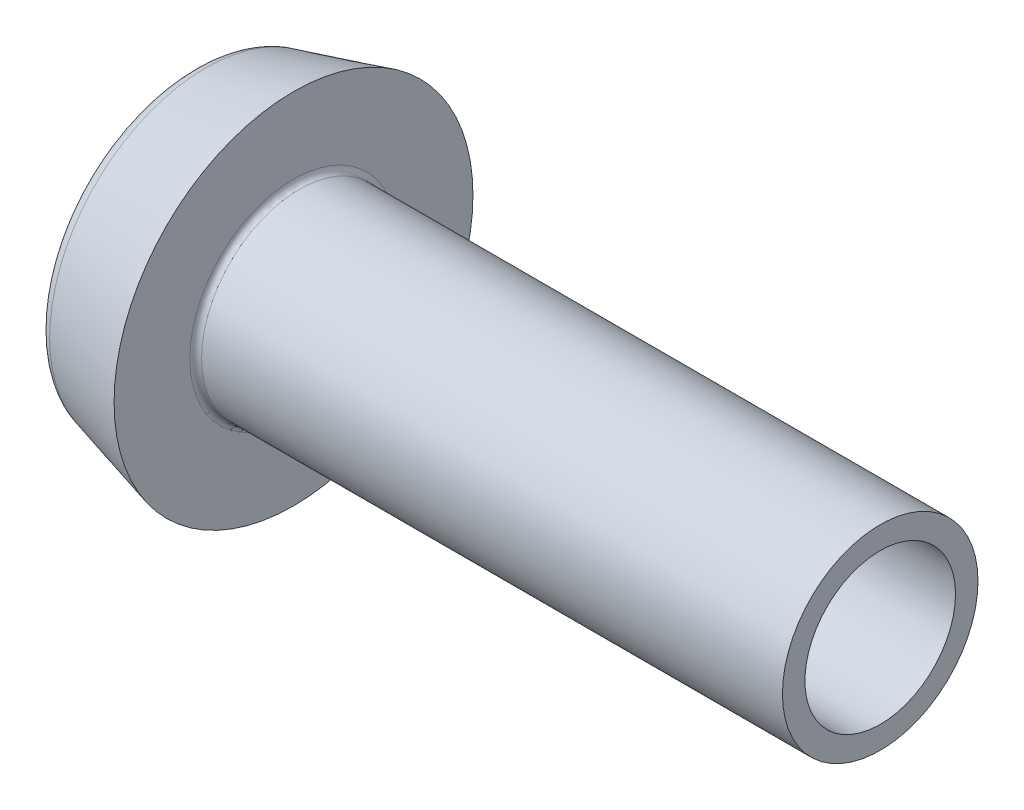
ISO-10303-21;
HEADER;
FILE_DESCRIPTION(('STEP AP214'),'2;1');
FILE_NAME('part.step','',(''),(''),'','','');
FILE_SCHEMA(('AUTOMOTIVE_DESIGN { 1 0 10303 214 1 1 1 1 }'));
ENDSEC;
DATA;
#1=APPLICATION_CONTEXT('core data for automotive mechanical design processes');
#2=APPLICATION_PROTOCOL_DEFINITION('international standard','automotive_design',2000,#1);
#3=PRODUCT_CONTEXT('',#1,'mechanical');
#4=PRODUCT('Part','Part','',(#3));
#5=PRODUCT_RELATED_PRODUCT_CATEGORY('part','',(#4));
#6=PRODUCT_DEFINITION_FORMATION('','',#4);
#7=PRODUCT_DEFINITION_CONTEXT('part definition',#1,'design');
#8=PRODUCT_DEFINITION('design','',#6,#7);
#9=PRODUCT_DEFINITION_SHAPE('','',#8);
#10=(LENGTH_UNIT() NAMED_UNIT(*) SI_UNIT(.MILLI.,.METRE.));
#11=(NAMED_UNIT(*) PLANE_ANGLE_UNIT() SI_UNIT($,.RADIAN.));
#12=(NAMED_UNIT(*) SI_UNIT($,.STERADIAN.) SOLID_ANGLE_UNIT());
#13=UNCERTAINTY_MEASURE_WITH_UNIT(LENGTH_MEASURE(1.E-05),#10,'distance_accuracy_value','');
#14=(GEOMETRIC_REPRESENTATION_CONTEXT(3) GLOBAL_UNCERTAINTY_ASSIGNED_CONTEXT((#13)) GLOBAL_UNIT_ASSIGNED_CONTEXT((#10,
#11,#12)) REPRESENTATION_CONTEXT('',''));
#15=CARTESIAN_POINT('',(0.,0.,0.));
#16=DIRECTION('',(0.,0.,1.));
#17=DIRECTION('',(1.,0.,0.));
#18=AXIS2_PLACEMENT_3D('',#15,#16,#17);
#19=CARTESIAN_POINT('',(35.24,0.,0.));
#20=DIRECTION('',(-1.,0.,0.));
#21=DIRECTION('',(0.,0.,1.));
#22=AXIS2_PLACEMENT_3D('',#19,#20,#21);
#23=PLANE('',#22);
#24=CARTESIAN_POINT('',(35.24,0.,0.));
#25=DIRECTION('',(1.,0.,0.));
#26=DIRECTION('',(0.,0.,-1.));
#27=AXIS2_PLACEMENT_3D('',#24,#25,#26);
#28=CIRCLE('',#27,3.85);
#29=CARTESIAN_POINT('',(35.24,0.,-3.85));
#30=VERTEX_POINT('',#29);
#31=EDGE_CURVE('E53',#30,#30,#28,.T.);
#32=ORIENTED_EDGE('',*,*,#31,.F.);
#33=EDGE_LOOP('',(#32));
#34=FACE_BOUND('',#33,.T.);
#35=CARTESIAN_POINT('',(35.24,0.,0.));
#36=DIRECTION('',(-1.,0.,0.));
#37=DIRECTION('',(0.,0.,1.));
#38=AXIS2_PLACEMENT_3D('',#35,#36,#37);
#39=CIRCLE('',#38,5.);
#40=CARTESIAN_POINT('',(35.24,0.,5.));
#41=VERTEX_POINT('',#40);
#42=EDGE_CURVE('E11',#41,#41,#39,.T.);
#43=ORIENTED_EDGE('',*,*,#42,.F.);
#44=EDGE_LOOP('',(#43));
#45=FACE_BOUND('',#44,.T.);
#46=ADVANCED_FACE('F33',(#34,#45),#23,.F.);
#47=CARTESIAN_POINT('',(-47.2170391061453,0.,0.));
#48=DIRECTION('',(-1.,0.,0.));
#49=DIRECTION('',(0.,0.,1.));
#50=AXIS2_PLACEMENT_3D('',#47,#48,#49);
#51=CYLINDRICAL_SURFACE('',#50,5.);
#52=CARTESIAN_POINT('',(5.54,0.,0.));
#53=DIRECTION('',(-1.,0.,0.));
#54=DIRECTION('',(0.,0.,1.));
#55=AXIS2_PLACEMENT_3D('',#52,#53,#54);
#56=CIRCLE('',#55,5.);
#57=CARTESIAN_POINT('',(5.54,0.,5.));
#58=VERTEX_POINT('',#57);
#59=EDGE_CURVE('E39',#58,#58,#56,.T.);
#60=ORIENTED_EDGE('',*,*,#59,.F.);
#61=EDGE_LOOP('',(#60));
#62=FACE_BOUND('',#61,.T.);
#63=ORIENTED_EDGE('',*,*,#42,.T.);
#64=EDGE_LOOP('',(#63));
#65=FACE_BOUND('',#64,.T.);
#66=ADVANCED_FACE('F73',(#62,#65),#51,.T.);
#67=CARTESIAN_POINT('',(5.54,0.,0.));
#68=DIRECTION('',(-1.,0.,0.));
#69=DIRECTION('',(0.,0.,1.));
#70=AXIS2_PLACEMENT_3D('',#67,#68,#69);
#71=TOROIDAL_SURFACE('',#70,5.3,0.299999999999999);
#72=CARTESIAN_POINT('',(5.23999999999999,0.,0.));
#73=DIRECTION('',(-1.,0.,0.));
#74=DIRECTION('',(0.,0.,1.));
#75=AXIS2_PLACEMENT_3D('',#72,#73,#74);
#76=CIRCLE('',#75,5.3);
#77=CARTESIAN_POINT('',(5.23999999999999,0.,5.3));
#78=VERTEX_POINT('',#77);
#79=EDGE_CURVE('E66',#78,#78,#76,.T.);
#80=ORIENTED_EDGE('',*,*,#79,.F.);
#81=EDGE_LOOP('',(#80));
#82=FACE_BOUND('',#81,.T.);
#83=ORIENTED_EDGE('',*,*,#59,.T.);
#84=EDGE_LOOP('',(#83));
#85=FACE_BOUND('',#84,.T.);
#86=ADVANCED_FACE('F71',(#82,#85),#71,.F.);
#87=CARTESIAN_POINT('',(5.24,5.3,0.));
#88=DIRECTION('',(-1.,0.,0.));
#89=DIRECTION('',(0.,0.,1.));
#90=AXIS2_PLACEMENT_3D('',#87,#88,#89);
#91=PLANE('',#90);
#92=CARTESIAN_POINT('',(5.23999999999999,0.,0.));
#93=DIRECTION('',(-1.,0.,0.));
#94=DIRECTION('',(0.,0.,1.));
#95=AXIS2_PLACEMENT_3D('',#92,#93,#94);
#96=CIRCLE('',#95,9.175);
#97=CARTESIAN_POINT('',(5.23999999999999,0.,9.175));
#98=VERTEX_POINT('',#97);
#99=EDGE_CURVE('E63',#98,#98,#96,.T.);
#100=ORIENTED_EDGE('',*,*,#99,.F.);
#101=EDGE_LOOP('',(#100));
#102=FACE_BOUND('',#101,.T.);
#103=ORIENTED_EDGE('',*,*,#79,.T.);
#104=EDGE_LOOP('',(#103));
#105=FACE_BOUND('',#104,.T.);
#106=ADVANCED_FACE('F99',(#102,#105),#91,.F.);
#107=CARTESIAN_POINT('',(5.23999999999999,0.,0.));
#108=DIRECTION('',(1.,0.,0.));
#109=DIRECTION('',(0.,0.,-1.));
#110=AXIS2_PLACEMENT_3D('',#107,#108,#109);
#111=CONICAL_SURFACE('',#110,9.175,0.261799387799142);
#112=CARTESIAN_POINT('',(0.741180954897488,0.,0.));
#113=DIRECTION('',(-1.,0.,0.));
#114=DIRECTION('',(0.,0.,1.));
#115=AXIS2_PLACEMENT_3D('',#112,#113,#114);
#116=CIRCLE('',#115,7.96954506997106);
#117=CARTESIAN_POINT('',(0.741180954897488,0.,7.96954506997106));
#118=VERTEX_POINT('',#117);
#119=EDGE_CURVE('E56',#118,#118,#116,.T.);
#120=ORIENTED_EDGE('',*,*,#119,.F.);
#121=EDGE_LOOP('',(#120));
#122=FACE_BOUND('',#121,.T.);
#123=ORIENTED_EDGE('',*,*,#99,.T.);
#124=EDGE_LOOP('',(#123));
#125=FACE_BOUND('',#124,.T.);
#126=ADVANCED_FACE('F95',(#122,#125),#111,.T.);
#127=CARTESIAN_POINT('',(1.,0.,0.));
#128=DIRECTION('',(-1.,0.,0.));
#129=DIRECTION('',(0.,0.,1.));
#130=AXIS2_PLACEMENT_3D('',#127,#128,#129);
#131=TOROIDAL_SURFACE('',#130,7.00361924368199,1.);
#132=CARTESIAN_POINT('',(0.,0.,0.));
#133=DIRECTION('',(-1.,0.,0.));
#134=DIRECTION('',(0.,0.,1.));
#135=AXIS2_PLACEMENT_3D('',#132,#133,#134);
#136=CIRCLE('',#135,7.00361924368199);
#137=CARTESIAN_POINT('',(0.,0.,7.00361924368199));
#138=VERTEX_POINT('',#137);
#139=EDGE_CURVE('E52',#138,#138,#136,.T.);
#140=ORIENTED_EDGE('',*,*,#139,.F.);
#141=EDGE_LOOP('',(#140));
#142=FACE_BOUND('',#141,.T.);
#143=ORIENTED_EDGE('',*,*,#119,.T.);
#144=EDGE_LOOP('',(#143));
#145=FACE_BOUND('',#144,.T.);
#146=ADVANCED_FACE('F91',(#142,#145),#131,.T.);
#147=CARTESIAN_POINT('',(0.,7.00361924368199,0.));
#148=DIRECTION('',(1.,0.,0.));
#149=DIRECTION('',(0.,0.,-1.));
#150=AXIS2_PLACEMENT_3D('',#147,#148,#149);
#151=PLANE('',#150);
#152=ORIENTED_EDGE('',*,*,#139,.T.);
#153=EDGE_LOOP('',(#152));
#154=FACE_BOUND('',#153,.T.);
#155=ADVANCED_FACE('F46',(#154),#151,.F.);
#156=CARTESIAN_POINT('',(25.61,0.,0.));
#157=DIRECTION('',(1.,0.,0.));
#158=DIRECTION('',(0.,0.,-1.));
#159=AXIS2_PLACEMENT_3D('',#156,#157,#158);
#160=CONICAL_SURFACE('',#159,3.85,0.94247779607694);
#161=CARTESIAN_POINT('',(22.8128112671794,0.,0.));
#162=VERTEX_POINT('',#161);
#163=VERTEX_LOOP('',#162);
#164=FACE_BOUND('',#163,.T.);
#165=CARTESIAN_POINT('',(25.61,0.,0.));
#166=DIRECTION('',(1.,0.,0.));
#167=DIRECTION('',(0.,0.,-1.));
#168=AXIS2_PLACEMENT_3D('',#165,#166,#167);
#169=CIRCLE('',#168,3.85);
#170=CARTESIAN_POINT('',(25.61,0.,-3.85));
#171=VERTEX_POINT('',#170);
#172=EDGE_CURVE('E50',#171,#171,#169,.T.);
#173=ORIENTED_EDGE('',*,*,#172,.T.);
#174=EDGE_LOOP('',(#173));
#175=FACE_BOUND('',#174,.T.);
#176=ADVANCED_FACE('F42',(#164,#175),#160,.F.);
#177=CARTESIAN_POINT('',(1.35622594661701,0.,0.));
#178=DIRECTION('',(1.,0.,0.));
#179=DIRECTION('',(0.,0.,-1.));
#180=AXIS2_PLACEMENT_3D('',#177,#178,#179);
#181=CYLINDRICAL_SURFACE('',#180,3.85);
#182=ORIENTED_EDGE('',*,*,#172,.F.);
#183=EDGE_LOOP('',(#182));
#184=FACE_BOUND('',#183,.T.);
#185=ORIENTED_EDGE('',*,*,#31,.T.);
#186=EDGE_LOOP('',(#185));
#187=FACE_BOUND('',#186,.T.);
#188=ADVANCED_FACE('F45',(#184,#187),#181,.F.);
#189=CLOSED_SHELL('',(#46,#66,#86,#106,#126,#146,#155,#176,#188));
#190=MANIFOLD_SOLID_BREP('B2',#189);
#191=ADVANCED_BREP_SHAPE_REPRESENTATION('',(#18,#190),#14);
#192=SHAPE_DEFINITION_REPRESENTATION(#9,#191);
ENDSEC;
END-ISO-10303-21;
